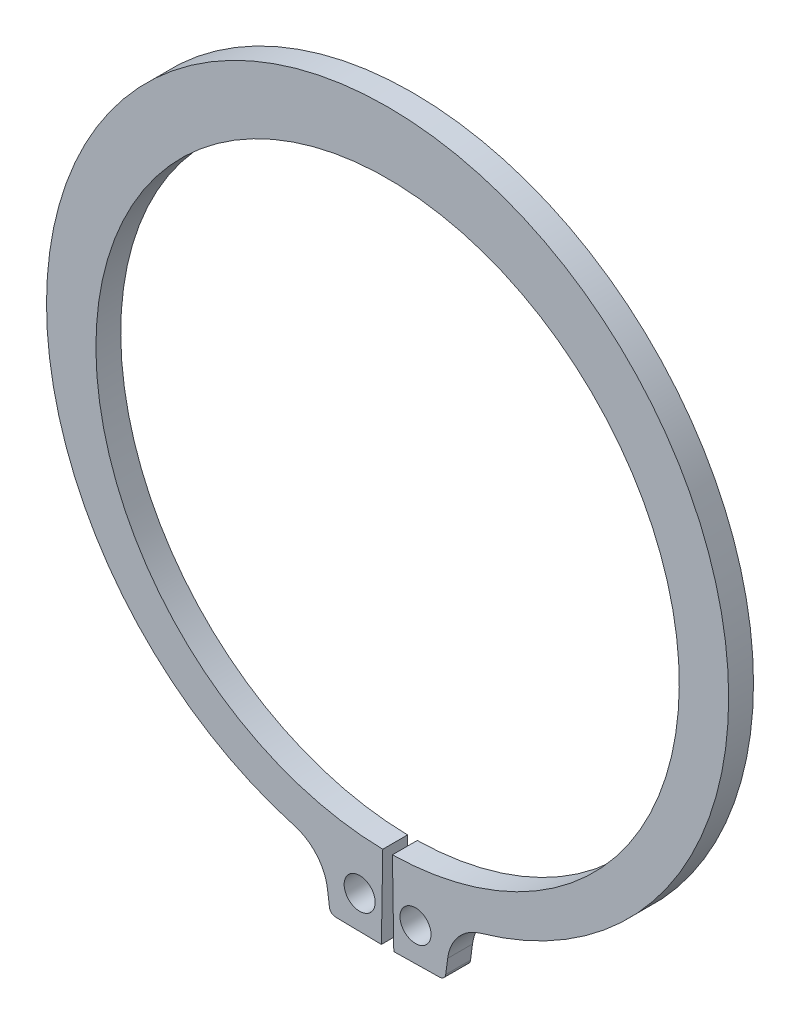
from build123d import *

# Parameters (mm, degrees)
BODYSKE_R  = 1.25
BODY_DEPTH = 2


with BuildPart() as part:
    # BodySke → Body (new body)
    with BuildSketch(Plane.XY):
        with BuildLine():
            Line((0.389072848, -23.496778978), (0.5, -30.195860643))
            Line((0.5, -30.195860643), (4.195122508, -30.134674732))
            ThreePointArc((4.195122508, -30.134674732), (4.519617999, -30.007921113), (4.682566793, -29.700006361))
            Line((4.682566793, -29.700006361), (4.841420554, -28.493392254))
            ThreePointArc((4.841420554, -28.493392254), (5.710150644, -26.557262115), (7.499838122, -25.416950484))
            ThreePointArc((7.499838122, -25.416950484), (0, 28.5), (-7.499838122, -25.416950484))
            ThreePointArc((-7.499838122, -25.416950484), (-5.710150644, -26.557262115), (-4.841420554, -28.493392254))
            Line((-4.841420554, -28.493392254), (-4.682566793, -29.700006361))
            ThreePointArc((-4.682566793, -29.700006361), (-4.519617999, -30.007921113), (-4.195122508, -30.134674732))
            Line((-4.195122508, -30.134674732), (-0.5, -30.195860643))
            Line((-0.5, -30.195860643), (-0.389072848, -23.496778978))
            ThreePointArc((-0.389072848, -23.496778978), (0, 23.5), (0.389072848, -23.496778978))
        make_face()
        with Locations((2.25, -27.50813516)):
            Circle(BODYSKE_R, mode=Mode.SUBTRACT)
        with Locations((-2.25, -27.50813516)):
            Circle(BODYSKE_R, mode=Mode.SUBTRACT)
    extrude(amount=-BODY_DEPTH)


solid = part.part
